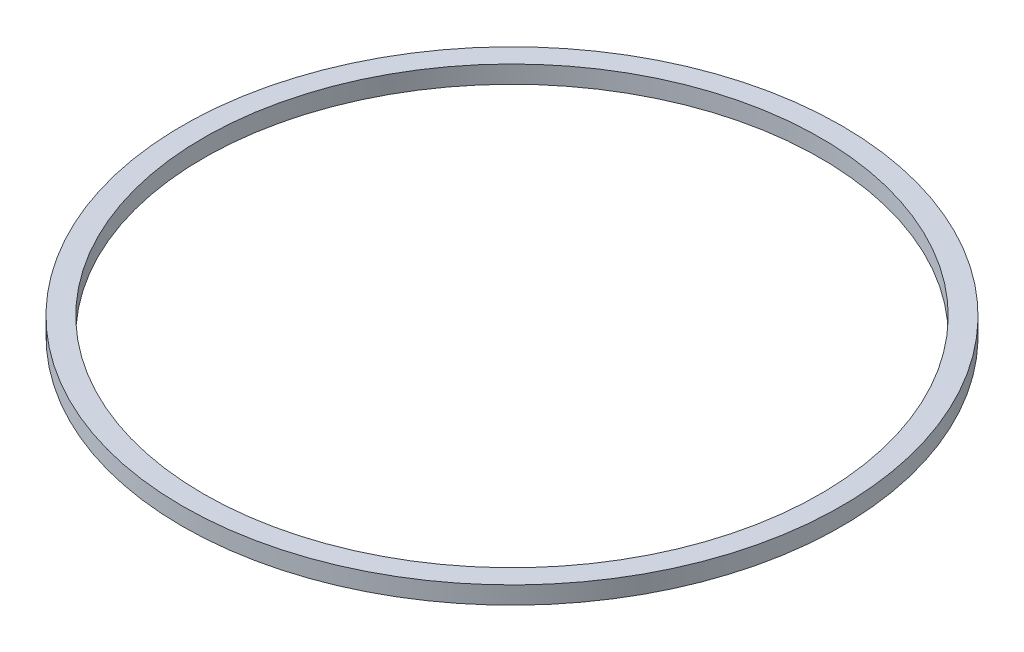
from build123d import *

# Parameters (mm, degrees)
SKETCH_1_R      = 18.759
SKETCH_1_R_2    = 17.559
EXTRUDE_1_DEPTH = 1


with BuildPart() as part:
    # Sketch 1 → Extrude 1 (new body)
    with BuildSketch(Plane(origin=(0, 0, 0), x_dir=(1, 0, 0), z_dir=(0, 1, 0))):
        with Locations(Location((0, 0, 0), (0, 0, 270))):
            Circle(SKETCH_1_R)
        with Locations(Location((0, 0, 0), (0, 0, 270))):
            Circle(SKETCH_1_R_2, mode=Mode.SUBTRACT)
    extrude(amount=EXTRUDE_1_DEPTH)


solid = part.part
